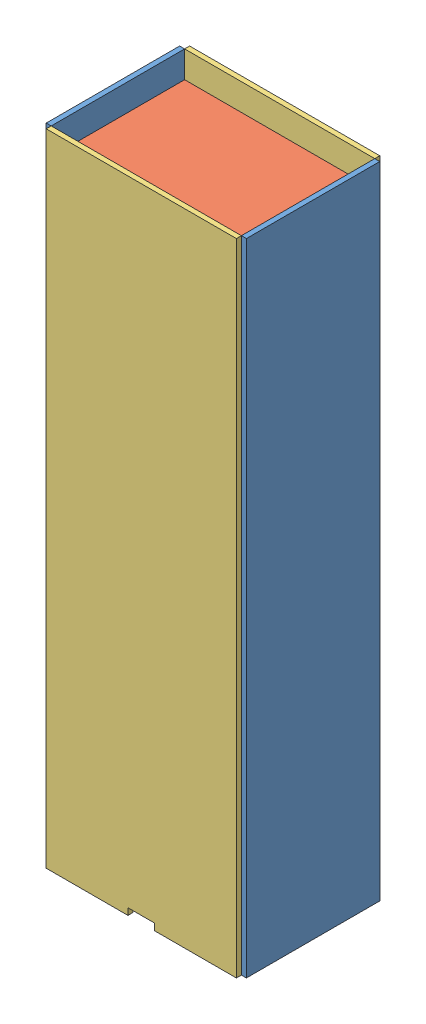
SolidWorks assembly 24 inch Building.SLDASM, configuration Default (file format 9000). Lengths in mm.
Overall size (190.53 609.6 136.57).
6 component instances, 3 part files, 19 mates.
Components (placement in the parent):
- 5 in x 24 in Corrugated Plastic-3: 5 in x 24 in Corrugated Plastic.SLDPRT [Default] at (49.8223 609.6 16.766) x (-0.000251 0 -1) z (0 1 0) size (127 4.76 609.6)
- 5 in x 7.125 in Corrugated Plastic-1: 5 in x 7.125 in Corrugated Plastic.SLDPRT [Default] at (49.8223 579.4375 16.766) x (1 0 -0.000251) z (0.000251 0 1) size (180.97 4.76 127)
- 7.125 in x 24 in Corrugated Plastic-1: 7.125 in x 24 in Corrugated Plastic.SLDPRT [Default] at (49.8223 0 16.766) x (1 0 -0.000251) z (0 -1 0) size (180.97 4.76 609.6)
- 5 in x 7.125 in Corrugated Plastic-2: 5 in x 7.125 in Corrugated Plastic.SLDPRT [Default] at (49.8223 6.35 16.766) x (1 0 -0.000251) z (0.000251 0 1) size (180.97 4.76 127)
- 5 in x 24 in Corrugated Plastic-4: 5 in x 24 in Corrugated Plastic.SLDPRT [Default] at (235.5598 609.6 16.7195) x (-0.000251 0 -1) z (0 1 0) size (127 4.76 609.6)
- 7.125 in x 24 in Corrugated Plastic-2: 7.125 in x 24 in Corrugated Plastic.SLDPRT [Default] at (49.7893 0 -114.9965) x (1 0 -0.000251) z (0 -1 0) size (180.97 4.76 609.6)
Mates (geometry in assembly coordinates):
- Coincident12: coincident anti-aligned: plane of 5 in x 24 in Corrugated Plastic-3 through (45.0598 0 16.7672) normal (0 -1 0); plane of assembly through (0 0 0) normal (0 1 0)
- Coincident18: coincident anti-aligned: plane of ? through (-26.0854 0 184.632) normal (0 -1 0); plane of assembly through (0 0 0) normal (0 1 0)
- Coincident19: coincident anti-aligned: plane of 5 in x 24 in Corrugated Plastic-3 through (49.8223 609.6 16.766) normal (1 0 -0.000251); plane of 5 in x 7.125 in Corrugated Plastic-1 through (49.8223 584.2 16.766) normal (-1 0 0.000251)
- Coincident20: coincident anti-aligned: plane of 7.125 in x 24 in Corrugated Plastic-1 through (153.011 0 21.5027) normal (0 -1 0); plane of assembly through (0 0 0) normal (0 1 0)
- Coincident21: coincident anti-aligned: line of 5 in x 24 in Corrugated Plastic-3 through (49.8223 0 16.766) axis (0 1 0); line of 7.125 in x 24 in Corrugated Plastic-1 through (49.8223 609.6 16.766) axis (0 -1 0)
- Coincident22: coincident anti-aligned: plane of 5 in x 7.125 in Corrugated Plastic-1 through (49.8223 584.2 16.766) normal (0.000251 0 1); plane of 7.125 in x 24 in Corrugated Plastic-1 through (49.8223 0 16.766) normal (-0.000251 0 -1)
- Distance1: distance = 25.4 mm aligned: plane of 5 in x 7.125 in Corrugated Plastic-1 through (49.8223 584.2 16.766) normal (0 1 0); plane of 7.125 in x 24 in Corrugated Plastic-1 through (49.8235 609.6 21.5285) normal (0 1 0)
- Coincident25: coincident anti-aligned: plane of 7.125 in x 24 in Corrugated Plastic-1 through (49.8223 0 16.766) normal (-0.000251 0 -1); plane of 5 in x 7.125 in Corrugated Plastic-2 through (49.8223 11.1125 16.766) normal (0.000251 0 1)
- Coincident26: coincident anti-aligned: plane of 5 in x 24 in Corrugated Plastic-3 through (49.8223 609.6 16.766) normal (1 0 -0.000251); plane of 5 in x 7.125 in Corrugated Plastic-2 through (49.8223 11.1125 16.766) normal (-1 0 0.000251)
- Distance2: distance = 6.35 mm aligned: plane of 5 in x 7.125 in Corrugated Plastic-2 through (49.8223 6.35 16.766) normal (0 -1 0); plane of 7.125 in x 24 in Corrugated Plastic-1 through (153.011 0 21.5027) normal (0 -1 0)
- Coincident30: coincident anti-aligned: plane of 5 in x 7.125 in Corrugated Plastic-1 through (230.7973 584.2 16.7207) normal (1 0 -0.000251); plane of 5 in x 24 in Corrugated Plastic-4 through (230.7973 609.6 16.7207) normal (-1 0 0.000251)
- Coincident31: coincident anti-aligned: plane of 5 in x 7.125 in Corrugated Plastic-2 through (230.7973 11.1125 16.7207) normal (1 0 -0.000251); plane of 5 in x 24 in Corrugated Plastic-4 through (230.7973 609.6 16.7207) normal (-1 0 0.000251)
- Coincident32: coincident aligned: line of 7.125 in x 24 in Corrugated Plastic-1 through (230.7973 0 16.7207) axis (0 1 0); line of 5 in x 24 in Corrugated Plastic-4 through (230.7973 0 16.7207) axis (0 1 0)
- Coincident33: coincident anti-aligned: plane of 5 in x 24 in Corrugated Plastic-4 through (230.7973 0 16.7207) normal (0 -1 0); plane of assembly through (0 0 0) normal (0 1 0)
- Coincident34: coincident anti-aligned: plane of 5 in x 7.125 in Corrugated Plastic-1 through (49.7905 584.2 -110.234) normal (-0.000251 0 -1); plane of 7.125 in x 24 in Corrugated Plastic-2 through (49.7905 0 -110.234) normal (0.000251 0 1)
- Coincident35: coincident anti-aligned: plane of 5 in x 7.125 in Corrugated Plastic-2 through (49.7905 11.1125 -110.234) normal (-0.000251 0 -1); plane of 7.125 in x 24 in Corrugated Plastic-2 through (49.7905 0 -110.234) normal (0.000251 0 1)
- Coincident36: coincident aligned: line of 5 in x 24 in Corrugated Plastic-3 through (49.7905 609.6 -110.234) axis (0 -1 0); line of 7.125 in x 24 in Corrugated Plastic-2 through (49.7905 609.6 -110.234) axis (0 -1 0)
- Coincident37: coincident anti-aligned: line of 5 in x 24 in Corrugated Plastic-4 through (230.7655 609.6 -110.2793) axis (0 -1 0); line of 7.125 in x 24 in Corrugated Plastic-2 through (230.7655 0 -110.2793) axis (0 1 0)
- Coincident38: coincident anti-aligned: plane of 7.125 in x 24 in Corrugated Plastic-2 through (152.978 0 -110.2598) normal (0 -1 0); plane of assembly through (0 0 0) normal (0 1 0)
